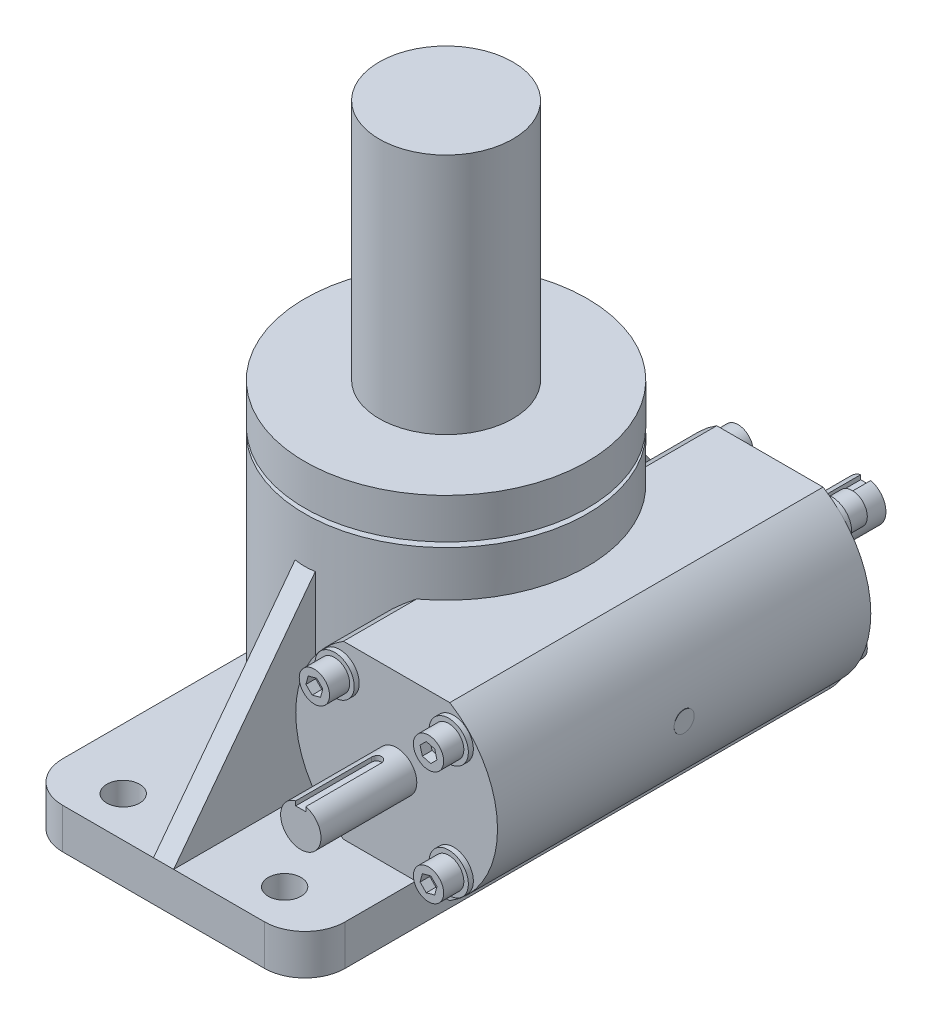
from build123d import *

# Parameters (mm, degrees)
BOSS_EXTRUDE2_DEPTH      = 58.7375
BOSS_EXTRUDE2_DEPTH_BACK = 58.7375
SKETCH3_W                = 177.8
SKETCH3_H                = 6.35
SKETCH5_W                = 88.9
SKETCH5_H                = 177.8
SKETCH5_R                = 5.159375
BOSS_EXTRUDE3_DEPTH      = 12.7
SKETCH7_W                = 3.175
SKETCH7_H                = 3.175
CUT_KEYWAY1_DEPTH        = 1.5875
CUT_KEYWAY2_REACH        = 174.182
CUT_KEYWAY2_END_RADIUS   = 6.35
RIB1_REACH               = 213.113
SKETCH8_WALL_W           = 497.886027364
SKETCH8_WALL_H           = 6.35
FILLET1_R                = 12.7
SKETCH11_R               = 6.1849
BOSS_EXTRUDE1_DEPTH      = 1.5748
SKETCH31_R               = 4.7625
BOSS_EXTRUDE21_DEPTH     = 6.35
CUT_EXTRUDE1_DEPTH       = 3.048
CIRPATTERN1_COUNT        = 4
MIRROR3_COPY_1_SKETCH_R  = 6.1849
MIRROR3_COPY_1_DEPTH     = 1.5748
MIRROR3_COPY_2_SKETCH_R  = 6.1849
MIRROR3_COPY_2_DEPTH     = 1.5748
MIRROR3_COPY_3_SKETCH_R  = 6.1849
MIRROR3_COPY_3_DEPTH     = 1.5748
MIRROR3_COPY_4_SKETCH_R  = 4.7625
MIRROR3_COPY_4_DEPTH     = 6.35
MIRROR3_COPY_5_SKETCH_R  = 4.7625
MIRROR3_COPY_5_DEPTH     = 6.35
MIRROR3_COPY_6_SKETCH_R  = 4.7625
MIRROR3_COPY_6_DEPTH     = 6.35
MIRROR3_COPY_7_DEPTH     = 3.048
MIRROR3_COPY_8_DEPTH     = 3.048
MIRROR3_COPY_9_DEPTH     = 3.048


with BuildPart() as part:
    # Sketch1 → Base-Revolve (revolve)
    with BuildSketch(Plane.XY, mode=Mode.PRIVATE) as base_revolve_sk:
        Polygon((0, 0), (-44.45, 0), (-44.45, 85.7885), (-38.862, 85.7885), (-38.862, 87.3125), (-44.45, 87.3125), (-44.45, 100.0125), (-21.034375, 100.0125), (-21.034375, 176.2125), (0, 176.2125), align=None)
    revolve(base_revolve_sk.sketch.rotate(Axis((0, 0, 0), (0, 1, 0)), 270), axis=Axis((0, 0, 0), (0, 1, 0)))

    # Sketch2 → Boss-Extrude2 (add, two sides: drawn at the far end of the back side and taken through both)
    with BuildSketch(Plane.XY.offset(-BOSS_EXTRUDE2_DEPTH_BACK)):
        with BuildLine():
            Line((26.454649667, 17.4625), (59.905350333, 17.4625))
            ThreePointArc((59.905350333, 17.4625), (74.93, 44.45), (59.905350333, 71.4375))
            Line((59.905350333, 71.4375), (26.454649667, 71.4375))
            ThreePointArc((26.454649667, 71.4375), (11.43, 44.45), (26.454649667, 17.4625))
        make_face()
    extrude(amount=BOSS_EXTRUDE2_DEPTH + BOSS_EXTRUDE2_DEPTH_BACK)

    # Sketch3 → Boss-Revolve1 (revolve)
    with BuildSketch(Plane.ZY.offset(-43.18), mode=Mode.PRIVATE) as boss_revolve1_sk:
        with Locations((0, 41.275)):
            Rectangle(SKETCH3_W, SKETCH3_H)
    revolve(boss_revolve1_sk.sketch.rotate(Axis((43.18, 44.45, -105.895333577), (0, 0, 1)), 270), axis=Axis((43.18, 44.45, -105.895333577), (0, 0, 1)))

    # Sketch5 → Boss-Extrude3 (add)
    with BuildSketch(Plane(origin=(0, 0, 0), x_dir=(-1, 0, 0), z_dir=(0, 1, 0))):
        Rectangle(SKETCH5_W, SKETCH5_H)
        with Locations(Location((25.4, -76.2, 0), (0, 0, 90))):
            Circle(SKETCH5_R, mode=Mode.SUBTRACT)
        with Locations(Location((-25.4, -76.2, 0), (0, 0, 90))):
            Circle(SKETCH5_R, mode=Mode.SUBTRACT)
        with Locations(Location((-25.4, 76.2, 0), (0, 0, 90))):
            Circle(SKETCH5_R, mode=Mode.SUBTRACT)
        with Locations(Location((25.4, 76.2, 0), (0, 0, 90))):
            Circle(SKETCH5_R, mode=Mode.SUBTRACT)
    extrude(amount=BOSS_EXTRUDE3_DEPTH)

    # Sketch7 → Boss-Revolve2 (revolve)
    with BuildSketch(Plane.XY):
        with Locations((73.3425, 42.8625)):
            Rectangle(SKETCH7_W, SKETCH7_H)
    revolve(axis=Axis((43.18, 44.45, 0), (1, 0, 0)))

    # Sketch6 → Cut-Revolve1 (revolve, cut)
    with BuildSketch(Plane.XY, mode=Mode.PRIVATE) as cut_revolve1_sk:
        Polygon((0, 173.6725), (0, -41.275), (-12.7, -41.275), (-12.7, 84.7725), (-18.494375, 84.7725), (-18.494375, 100.0125), (-18.494375, 173.6725), align=None)
    revolve(cut_revolve1_sk.sketch.rotate(Axis((0, 0, 0), (0, 1, 0)), 270), axis=Axis((0, 0, 0), (0, 1, 0)), mode=Mode.SUBTRACT)

    # Sketch4 → Cut-Keyway1 (cut)
    with BuildSketch(Plane(origin=(0, 49.2125, 0), x_dir=(-1, 0, 0), z_dir=(0, 1, 0))):
        with BuildLine():
            Line((-44.7675, -88.9), (-41.5925, -88.9))
            Line((-41.5925, -88.9), (-41.5925, -65.0875))
            ThreePointArc((-41.5925, -65.0875), (-43.18, -63.5), (-44.7675, -65.0875))
            Line((-44.7675, -65.0875), (-44.7675, -88.9))
        make_face()
    extrude(amount=CUT_KEYWAY1_DEPTH, mode=Mode.SUBTRACT)

    # Cut-Keyway2: up to this cylinder (the profile starts inside it)
    cut_keyway2_end = Plane(origin=(43.18, 44.45, 76.367835), z_dir=(0, 0, -1)) * Cylinder(CUT_KEYWAY2_END_RADIUS, 362.064, mode=Mode.PRIVATE)
    # Sketch9 → Cut-Keyway2 (cut, up to the surface)
    with BuildSketch(Plane(origin=(0, 49.2125, 0), x_dir=(-1, 0, 0), z_dir=(0, 1, 0)), mode=Mode.PRIVATE) as cut_keyway2_sk1:
        with BuildLine():
            Line((-41.5925, 88.9), (-44.7675, 88.9))
            Line((-44.7675, 88.9), (-44.7675, 65.0875))
            ThreePointArc((-44.7675, 65.0875), (-43.18, 63.5), (-41.5925, 65.0875))
            Line((-41.5925, 65.0875), (-41.5925, 88.9))
        make_face()
    cut_keyway2_tool1 = extrude(cut_keyway2_sk1.sketch, amount=CUT_KEYWAY2_REACH, mode=Mode.PRIVATE) & cut_keyway2_end
    add(cut_keyway2_tool1.solids().sort_by_distance((43.18, 49.2125, 76.367835))[0], mode=Mode.SUBTRACT)

    # Sketch8 wall → Rib1 (add, up to next)
    with BuildSketch(Plane(origin=(0, 42.06875, 66.675), x_dir=(0, 0.797406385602, -0.603442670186), z_dir=(0, 0.603442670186, 0.797406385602)), mode=Mode.PRIVATE) as rib1_sk1:
        Rectangle(SKETCH8_WALL_W, SKETCH8_WALL_H)
    rib1_tool1 = extrude(rib1_sk1.sketch, amount=-RIB1_REACH, mode=Mode.PRIVATE) - part.part
    rib1 = rib1_tool1.solids().sort_by_distance((0, 42.06875, 66.675))[0]
    add(rib1)

    # Mirror2: Rib1 across plane
    add(rib1.mirror(Plane.XY))

    # Fillet1
    fillet1_edges = [part.edges().sort_by_distance(p)[0] for p in [
        (44.45, 6.35, 88.9),
        (-44.45, 6.35, 88.9),
        (-44.45, 6.35, -88.9),
        (44.45, 6.35, -88.9),
    ]]
    fillet(fillet1_edges, radius=FILLET1_R)

    # Sketch11 → Boss-Extrude1 (add)
    with BuildSketch(Plane(origin=(22.203548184, 31.435876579, 58.7375), x_dir=(1, 0, 0), z_dir=(0, 0, 1))):
        with Locations((38.936964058, -4.946388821)):
            Circle(SKETCH11_R)
    boss_extrude1 = extrude(amount=BOSS_EXTRUDE1_DEPTH)

    # Sketch31 → Boss-Extrude21 (add)
    with BuildSketch(Plane(origin=(22.203548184, 31.435876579, 60.3123), x_dir=(1, 0, 0), z_dir=(0, 0, 1))):
        with Locations((38.936964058, -4.946388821)):
            Circle(SKETCH31_R)
    boss_extrude21 = extrude(amount=BOSS_EXTRUDE21_DEPTH)

    # Sketch41 → Cut-Extrude1 (cut)
    with BuildSketch(Plane(origin=(22.203548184, 31.435876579, 66.6623), x_dir=(1, 0, 0), z_dir=(0, 0, 1))):
        Polygon((36.992681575, -3.002106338), (36.281024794, -5.658045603), (38.225307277, -7.602328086), (40.881246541, -6.890671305), (41.592903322, -4.23473204), (39.648620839, -2.290449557), align=None)
    cut_extrude1 = extrude(amount=-CUT_EXTRUDE1_DEPTH, mode=Mode.SUBTRACT)

    # CirPattern1: Boss-Extrude1, Boss-Extrude21, Cut-Extrude1 ×4 about axis
    cirpattern1_axis = Axis((43.18, 44.45, 0), (0, 0, 1))
    add([boss_extrude1.rotate(cirpattern1_axis, i * 360 / CIRPATTERN1_COUNT) for i in range(1, CIRPATTERN1_COUNT)])
    add([boss_extrude21.rotate(cirpattern1_axis, i * 360 / CIRPATTERN1_COUNT) for i in range(1, CIRPATTERN1_COUNT)])
    add([cut_extrude1.rotate(cirpattern1_axis, i * 360 / CIRPATTERN1_COUNT) for i in range(1, CIRPATTERN1_COUNT)], mode=Mode.SUBTRACT)

    # Mirror3: Boss-Extrude1, Boss-Extrude21, Cut-Extrude1 across plane
    add(boss_extrude1.mirror(Plane.XY))
    add(boss_extrude21.mirror(Plane.XY))
    add(cut_extrude1.mirror(Plane.XY), mode=Mode.SUBTRACT)

    # Mirror3 copy 1 sketch → Mirror3 copy 1 (add)
    with BuildSketch(Plane(origin=(56.194123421, 23.473548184, -58.7375), x_dir=(0, 1, 0), z_dir=(0, 0, -1))):
        with Locations((38.936964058, 4.946388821)):
            Circle(MIRROR3_COPY_1_SKETCH_R)
    extrude(amount=MIRROR3_COPY_1_DEPTH)

    # Mirror3 copy 2 sketch → Mirror3 copy 2 (add)
    with BuildSketch(Plane(origin=(64.156451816, 57.464123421, -58.7375), x_dir=(-1, 0, 0), z_dir=(0, 0, -1))):
        with Locations((38.936964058, 4.946388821)):
            Circle(MIRROR3_COPY_2_SKETCH_R)
    extrude(amount=MIRROR3_COPY_2_DEPTH)

    # Mirror3 copy 3 sketch → Mirror3 copy 3 (add)
    with BuildSketch(Plane(origin=(30.165876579, 65.426451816, -58.7375), x_dir=(0, -1, 0), z_dir=(0, 0, -1))):
        with Locations((38.936964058, 4.946388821)):
            Circle(MIRROR3_COPY_3_SKETCH_R)
    extrude(amount=MIRROR3_COPY_3_DEPTH)

    # Mirror3 copy 4 sketch → Mirror3 copy 4 (add)
    with BuildSketch(Plane(origin=(56.194123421, 23.473548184, -60.3123), x_dir=(0, 1, 0), z_dir=(0, 0, -1))):
        with Locations((38.936964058, 4.946388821)):
            Circle(MIRROR3_COPY_4_SKETCH_R)
    extrude(amount=MIRROR3_COPY_4_DEPTH)

    # Mirror3 copy 5 sketch → Mirror3 copy 5 (add)
    with BuildSketch(Plane(origin=(64.156451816, 57.464123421, -60.3123), x_dir=(-1, 0, 0), z_dir=(0, 0, -1))):
        with Locations((38.936964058, 4.946388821)):
            Circle(MIRROR3_COPY_5_SKETCH_R)
    extrude(amount=MIRROR3_COPY_5_DEPTH)

    # Mirror3 copy 6 sketch → Mirror3 copy 6 (add)
    with BuildSketch(Plane(origin=(30.165876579, 65.426451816, -60.3123), x_dir=(0, -1, 0), z_dir=(0, 0, -1))):
        with Locations((38.936964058, 4.946388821)):
            Circle(MIRROR3_COPY_6_SKETCH_R)
    extrude(amount=MIRROR3_COPY_6_DEPTH)

    # Mirror3 copy 7 sketch → Mirror3 copy 7 (cut)
    with BuildSketch(Plane(origin=(56.194123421, 23.473548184, -66.6623), x_dir=(0, 1, 0), z_dir=(0, 0, -1))):
        Polygon((36.992681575, 3.002106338), (36.281024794, 5.658045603), (38.225307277, 7.602328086), (40.881246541, 6.890671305), (41.592903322, 4.23473204), (39.648620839, 2.290449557), align=None)
    extrude(amount=-MIRROR3_COPY_7_DEPTH, mode=Mode.SUBTRACT)

    # Mirror3 copy 8 sketch → Mirror3 copy 8 (cut)
    with BuildSketch(Plane(origin=(64.156451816, 57.464123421, -66.6623), x_dir=(-1, 0, 0), z_dir=(0, 0, -1))):
        Polygon((36.992681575, 3.002106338), (36.281024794, 5.658045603), (38.225307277, 7.602328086), (40.881246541, 6.890671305), (41.592903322, 4.23473204), (39.648620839, 2.290449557), align=None)
    extrude(amount=-MIRROR3_COPY_8_DEPTH, mode=Mode.SUBTRACT)

    # Mirror3 copy 9 sketch → Mirror3 copy 9 (cut)
    with BuildSketch(Plane(origin=(30.165876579, 65.426451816, -66.6623), x_dir=(0, -1, 0), z_dir=(0, 0, -1))):
        Polygon((36.992681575, 3.002106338), (36.281024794, 5.658045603), (38.225307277, 7.602328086), (40.881246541, 6.890671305), (41.592903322, 4.23473204), (39.648620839, 2.290449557), align=None)
    extrude(amount=-MIRROR3_COPY_9_DEPTH, mode=Mode.SUBTRACT)


solid = part.part
